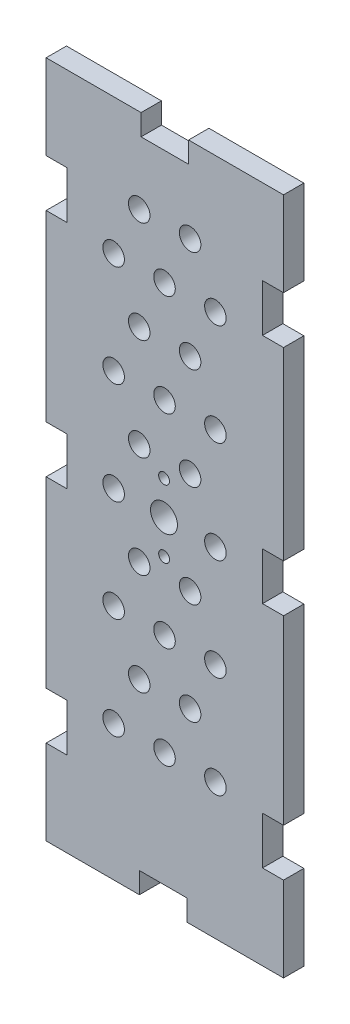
from build123d import *

# Parameters (mm, degrees)
SKETCH1_W           = 70
SKETCH1_H           = 200
BOSS_EXTRUDE2_DEPTH = 6
SKETCH4_W           = 14
SKETCH4_H           = 6.2
SKETCH4_W_2         = 6.2
SKETCH4_H_2         = 14
CUT_EXTRUDE1_DEPTH  = 6
SKETCH5_R           = 3.175
SKETCH5_R_2         = 3.975
SKETCH5_R_3         = 1.6
CUT_EXTRUDE2_DEPTH  = 6


with BuildPart() as part:
    # Sketch1 → Boss-Extrude2 (new body)
    with BuildSketch(Plane.XY):
        with Locations((35, 100)):
            Rectangle(SKETCH1_W, SKETCH1_H)
    extrude(amount=BOSS_EXTRUDE2_DEPTH)

    # Sketch4 → Cut-Extrude1 (cut)
    with BuildSketch(Plane.XY.offset(6)):
        with Locations((35, 196.9)):
            Rectangle(SKETCH4_W, SKETCH4_H)
        with Locations((34.5, 3.1)):
            Rectangle(SKETCH4_W, SKETCH4_H)
        with Locations((3.1, 168)):
            Rectangle(SKETCH4_W_2, SKETCH4_H_2)
        with Locations((3.1, 100)):
            Rectangle(SKETCH4_W_2, SKETCH4_H_2)
        with Locations((3.1, 32)):
            Rectangle(SKETCH4_W_2, SKETCH4_H_2)
        with Locations((66.9, 168)):
            Rectangle(SKETCH4_W_2, SKETCH4_H_2)
        with Locations((66.9, 99.5)):
            Rectangle(SKETCH4_W_2, SKETCH4_H_2)
        with Locations((66.9, 32)):
            Rectangle(SKETCH4_W_2, SKETCH4_H_2)
    extrude(amount=-CUT_EXTRUDE1_DEPTH, mode=Mode.SUBTRACT)

    # Sketch5 → Cut-Extrude2 (cut)
    with BuildSketch(Plane.XY.offset(6)):
        with Locations((19.909914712, 160)):
            Circle(SKETCH5_R)
        with Locations((34.909914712, 160)):
            Circle(SKETCH5_R)
        with Locations((27.44989339, 175)):
            Circle(SKETCH5_R)
        with Locations((49.909914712, 160)):
            Circle(SKETCH5_R)
        with Locations((42.44989339, 175)):
            Circle(SKETCH5_R)
        with Locations((19.909914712, 130)):
            Circle(SKETCH5_R)
        with Locations((34.909914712, 130)):
            Circle(SKETCH5_R)
        with Locations((27.44989339, 145)):
            Circle(SKETCH5_R)
        with Locations((49.909914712, 130)):
            Circle(SKETCH5_R)
        with Locations((42.44989339, 145)):
            Circle(SKETCH5_R)
        with Locations((19.909914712, 100)):
            Circle(SKETCH5_R)
        with Locations((34.75, 100)):
            Circle(SKETCH5_R_2)
        with Locations((27.44989339, 115)):
            Circle(SKETCH5_R)
        with Locations((49.909914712, 100)):
            Circle(SKETCH5_R)
        with Locations((42.44989339, 115)):
            Circle(SKETCH5_R)
        with Locations((19.909914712, 70)):
            Circle(SKETCH5_R)
        with Locations((34.909914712, 70)):
            Circle(SKETCH5_R)
        with Locations((27.44989339, 85)):
            Circle(SKETCH5_R)
        with Locations((49.909914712, 70)):
            Circle(SKETCH5_R)
        with Locations((42.44989339, 85)):
            Circle(SKETCH5_R)
        with Locations((19.909914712, 40)):
            Circle(SKETCH5_R)
        with Locations((34.909914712, 40)):
            Circle(SKETCH5_R)
        with Locations((27.44989339, 55)):
            Circle(SKETCH5_R)
        with Locations((49.909914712, 40)):
            Circle(SKETCH5_R)
        with Locations((42.44989339, 55)):
            Circle(SKETCH5_R)
        with Locations((34.776652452, 110)):
            Circle(SKETCH5_R_3)
        with Locations(Location((34.776652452, 90, 0), (0, 0, 180))):
            Circle(SKETCH5_R_3)
    extrude(amount=-CUT_EXTRUDE2_DEPTH, mode=Mode.SUBTRACT)


solid = part.part
